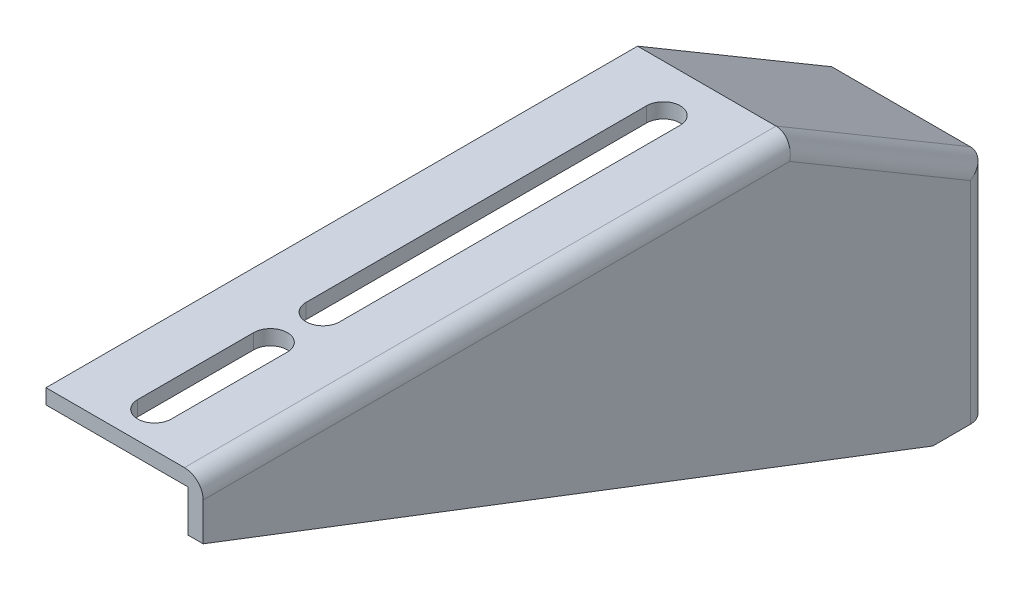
ISO-10303-21;
HEADER;
FILE_DESCRIPTION(('STEP AP214'),'2;1');
FILE_NAME('part.step','',(''),(''),'','','');
FILE_SCHEMA(('AUTOMOTIVE_DESIGN { 1 0 10303 214 1 1 1 1 }'));
ENDSEC;
DATA;
#1=APPLICATION_CONTEXT('core data for automotive mechanical design processes');
#2=APPLICATION_PROTOCOL_DEFINITION('international standard','automotive_design',2000,#1);
#3=PRODUCT_CONTEXT('',#1,'mechanical');
#4=PRODUCT('Part','Part','',(#3));
#5=PRODUCT_RELATED_PRODUCT_CATEGORY('part','',(#4));
#6=PRODUCT_DEFINITION_FORMATION('','',#4);
#7=PRODUCT_DEFINITION_CONTEXT('part definition',#1,'design');
#8=PRODUCT_DEFINITION('design','',#6,#7);
#9=PRODUCT_DEFINITION_SHAPE('','',#8);
#10=(LENGTH_UNIT() NAMED_UNIT(*) SI_UNIT(.MILLI.,.METRE.));
#11=(NAMED_UNIT(*) PLANE_ANGLE_UNIT() SI_UNIT($,.RADIAN.));
#12=(NAMED_UNIT(*) SI_UNIT($,.STERADIAN.) SOLID_ANGLE_UNIT());
#13=UNCERTAINTY_MEASURE_WITH_UNIT(LENGTH_MEASURE(1.E-05),#10,'distance_accuracy_value','');
#14=(GEOMETRIC_REPRESENTATION_CONTEXT(3) GLOBAL_UNCERTAINTY_ASSIGNED_CONTEXT((#13)) GLOBAL_UNIT_ASSIGNED_CONTEXT((#10,
#11,#12)) REPRESENTATION_CONTEXT('',''));
#15=CARTESIAN_POINT('',(0.,0.,0.));
#16=DIRECTION('',(0.,0.,1.));
#17=DIRECTION('',(1.,0.,0.));
#18=AXIS2_PLACEMENT_3D('',#15,#16,#17);
#19=CARTESIAN_POINT('',(17.5,-33.,5.));
#20=DIRECTION('',(0.,1.,0.));
#21=DIRECTION('',(-1.,0.,0.));
#22=AXIS2_PLACEMENT_3D('',#19,#20,#21);
#23=CYLINDRICAL_SURFACE('',#22,5.);
#24=DIRECTION('',(0.,1.,0.));
#25=VECTOR('',#24,1.);
#26=CARTESIAN_POINT('',(17.5,-3.99999999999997,0.));
#27=LINE('',#26,#25);
#28=CARTESIAN_POINT('',(17.5,-90.,0.));
#29=VERTEX_POINT('',#28);
#30=CARTESIAN_POINT('',(17.5,-30.7193009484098,0.));
#31=VERTEX_POINT('',#30);
#32=EDGE_CURVE('E205',#29,#31,#27,.T.);
#33=ORIENTED_EDGE('',*,*,#32,.T.);
#34=CARTESIAN_POINT('',(17.5,-33.5701747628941,5.));
#35=DIRECTION('',(0.,0.868711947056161,0.495317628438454));
#36=DIRECTION('',(0.,-0.495317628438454,0.868711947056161));
#37=AXIS2_PLACEMENT_3D('',#34,#35,#36);
#38=ELLIPSE('',#37,5.75564779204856,5.);
#39=CARTESIAN_POINT('',(22.5,-33.570174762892,5.));
#40=VERTEX_POINT('',#39);
#41=EDGE_CURVE('E183',#40,#31,#38,.T.);
#42=ORIENTED_EDGE('',*,*,#41,.F.);
#43=DIRECTION('',(0.,-1.,0.));
#44=VECTOR('',#43,1.);
#45=CARTESIAN_POINT('',(22.5,-3.99999999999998,5.));
#46=LINE('',#45,#44);
#47=CARTESIAN_POINT('',(22.5,-90.,5.));
#48=VERTEX_POINT('',#47);
#49=EDGE_CURVE('E261',#40,#48,#46,.T.);
#50=ORIENTED_EDGE('',*,*,#49,.T.);
#51=CARTESIAN_POINT('',(17.5,-90.,5.));
#52=DIRECTION('',(0.,1.,0.));
#53=DIRECTION('',(-1.,0.,0.));
#54=AXIS2_PLACEMENT_3D('',#51,#52,#53);
#55=CIRCLE('',#54,5.);
#56=EDGE_CURVE('E262',#29,#48,#55,.F.);
#57=ORIENTED_EDGE('',*,*,#56,.F.);
#58=EDGE_LOOP('',(#33,#42,#50,#57));
#59=FACE_BOUND('',#58,.T.);
#60=ADVANCED_FACE('F15',(#59),#23,.T.);
#61=CARTESIAN_POINT('',(17.5,-4.99999999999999,228.));
#62=DIRECTION('',(0.,0.,1.));
#63=DIRECTION('',(1.,0.,0.));
#64=AXIS2_PLACEMENT_3D('',#61,#62,#63);
#65=CYLINDRICAL_SURFACE('',#64,5.);
#66=DIRECTION('',(0.,0.,1.));
#67=VECTOR('',#66,1.);
#68=CARTESIAN_POINT('',(22.5,-4.99999999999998,53.));
#69=LINE('',#68,#67);
#70=CARTESIAN_POINT('',(22.5,-4.99999999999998,210.));
#71=VERTEX_POINT('',#70);
#72=CARTESIAN_POINT('',(22.5,-4.99999999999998,53.2737435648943));
#73=VERTEX_POINT('',#72);
#74=EDGE_CURVE('E179',#71,#73,#69,.F.);
#75=ORIENTED_EDGE('',*,*,#74,.T.);
#76=CARTESIAN_POINT('',(17.5,-4.99999999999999,53.2737435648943));
#77=DIRECTION('',(0.,0.264029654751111,0.96451456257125));
#78=DIRECTION('',(0.,0.96451456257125,-0.264029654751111));
#79=AXIS2_PLACEMENT_3D('',#76,#77,#78);
#80=ELLIPSE('',#79,5.18395490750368,5.);
#81=CARTESIAN_POINT('',(17.5,0.,51.905025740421));
#82=VERTEX_POINT('',#81);
#83=EDGE_CURVE('E18',#82,#73,#80,.F.);
#84=ORIENTED_EDGE('',*,*,#83,.F.);
#85=DIRECTION('',(0.,0.,-1.));
#86=VECTOR('',#85,1.);
#87=CARTESIAN_POINT('',(17.5,0.,53.));
#88=LINE('',#87,#86);
#89=CARTESIAN_POINT('',(17.5,0.,210.));
#90=VERTEX_POINT('',#89);
#91=EDGE_CURVE('E176',#82,#90,#88,.F.);
#92=ORIENTED_EDGE('',*,*,#91,.T.);
#93=CARTESIAN_POINT('',(17.5,-4.99999999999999,210.));
#94=DIRECTION('',(0.,0.,1.));
#95=DIRECTION('',(1.,0.,0.));
#96=AXIS2_PLACEMENT_3D('',#93,#94,#95);
#97=CIRCLE('',#96,5.);
#98=EDGE_CURVE('E259',#71,#90,#97,.T.);
#99=ORIENTED_EDGE('',*,*,#98,.F.);
#100=EDGE_LOOP('',(#75,#84,#92,#99));
#101=FACE_BOUND('',#100,.T.);
#102=ADVANCED_FACE('F174',(#101),#65,.T.);
#103=CARTESIAN_POINT('',(17.5,-5.35425210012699,52.6751796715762));
#104=DIRECTION('',(0.,0.509320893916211,0.860576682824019));
#105=DIRECTION('',(0.,-0.860576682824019,0.509320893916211));
#106=AXIS2_PLACEMENT_3D('',#103,#104,#105);
#107=CYLINDRICAL_SURFACE('',#106,5.);
#108=DIRECTION('',(0.,-0.509320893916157,-0.860576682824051));
#109=VECTOR('',#108,1.);
#110=CARTESIAN_POINT('',(22.5,-4.99999999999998,53.2737435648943));
#111=LINE('',#110,#109);
#112=EDGE_CURVE('E292',#73,#40,#111,.T.);
#113=ORIENTED_EDGE('',*,*,#112,.T.);
#114=ORIENTED_EDGE('',*,*,#41,.T.);
#115=DIRECTION('',(0.,-0.509320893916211,-0.860576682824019));
#116=VECTOR('',#115,1.);
#117=CARTESIAN_POINT('',(17.5,-0.557693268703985,50.962716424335));
#118=LINE('',#117,#116);
#119=EDGE_CURVE('E185',#31,#82,#118,.F.);
#120=ORIENTED_EDGE('',*,*,#119,.T.);
#121=ORIENTED_EDGE('',*,*,#83,.T.);
#122=EDGE_LOOP('',(#113,#114,#120,#121));
#123=FACE_BOUND('',#122,.T.);
#124=ADVANCED_FACE('F186',(#123),#107,.T.);
#125=CARTESIAN_POINT('',(18.5,0.,53.));
#126=DIRECTION('',(0.,-1.,0.));
#127=DIRECTION('',(0.,0.,-1.));
#128=AXIS2_PLACEMENT_3D('',#125,#126,#127);
#129=PLANE('',#128);
#130=DIRECTION('',(0.,0.,1.));
#131=VECTOR('',#130,1.);
#132=CARTESIAN_POINT('',(-4.50000000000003,0.,155.5));
#133=LINE('',#132,#131);
#134=CARTESIAN_POINT('',(-4.50000000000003,0.,155.5));
#135=VERTEX_POINT('',#134);
#136=CARTESIAN_POINT('',(-4.50000000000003,0.,64.5));
#137=VERTEX_POINT('',#136);
#138=EDGE_CURVE('E283',#135,#137,#133,.F.);
#139=ORIENTED_EDGE('',*,*,#138,.T.);
#140=CARTESIAN_POINT('',(0.,0.,64.5));
#141=DIRECTION('',(0.,1.,0.));
#142=DIRECTION('',(-1.,0.,0.));
#143=AXIS2_PLACEMENT_3D('',#140,#141,#142);
#144=CIRCLE('',#143,4.5);
#145=CARTESIAN_POINT('',(4.49999999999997,0.,64.5));
#146=VERTEX_POINT('',#145);
#147=EDGE_CURVE('E244',#137,#146,#144,.F.);
#148=ORIENTED_EDGE('',*,*,#147,.T.);
#149=DIRECTION('',(0.,0.,1.));
#150=VECTOR('',#149,1.);
#151=CARTESIAN_POINT('',(4.49999999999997,0.,64.5));
#152=LINE('',#151,#150);
#153=CARTESIAN_POINT('',(4.49999999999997,0.,155.5));
#154=VERTEX_POINT('',#153);
#155=EDGE_CURVE('E250',#146,#154,#152,.T.);
#156=ORIENTED_EDGE('',*,*,#155,.T.);
#157=CARTESIAN_POINT('',(0.,0.,155.5));
#158=DIRECTION('',(0.,1.,0.));
#159=DIRECTION('',(-1.,0.,0.));
#160=AXIS2_PLACEMENT_3D('',#157,#158,#159);
#161=CIRCLE('',#160,4.5);
#162=EDGE_CURVE('E248',#154,#135,#161,.F.);
#163=ORIENTED_EDGE('',*,*,#162,.T.);
#164=EDGE_LOOP('',(#139,#148,#156,#163));
#165=FACE_BOUND('',#164,.T.);
#166=DIRECTION('',(0.,0.,1.));
#167=VECTOR('',#166,1.);
#168=CARTESIAN_POINT('',(-4.50000000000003,0.,200.5));
#169=LINE('',#168,#167);
#170=CARTESIAN_POINT('',(-4.50000000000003,0.,200.5));
#171=VERTEX_POINT('',#170);
#172=CARTESIAN_POINT('',(-4.50000000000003,0.,169.5));
#173=VERTEX_POINT('',#172);
#174=EDGE_CURVE('E288',#171,#173,#169,.F.);
#175=ORIENTED_EDGE('',*,*,#174,.T.);
#176=CARTESIAN_POINT('',(0.,0.,169.5));
#177=DIRECTION('',(0.,1.,0.));
#178=DIRECTION('',(-1.,0.,0.));
#179=AXIS2_PLACEMENT_3D('',#176,#177,#178);
#180=CIRCLE('',#179,4.5);
#181=CARTESIAN_POINT('',(4.49999999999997,0.,169.5));
#182=VERTEX_POINT('',#181);
#183=EDGE_CURVE('E252',#173,#182,#180,.F.);
#184=ORIENTED_EDGE('',*,*,#183,.T.);
#185=DIRECTION('',(0.,0.,1.));
#186=VECTOR('',#185,1.);
#187=CARTESIAN_POINT('',(4.49999999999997,0.,169.5));
#188=LINE('',#187,#186);
#189=CARTESIAN_POINT('',(4.49999999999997,0.,200.5));
#190=VERTEX_POINT('',#189);
#191=EDGE_CURVE('E258',#182,#190,#188,.T.);
#192=ORIENTED_EDGE('',*,*,#191,.T.);
#193=CARTESIAN_POINT('',(0.,0.,200.5));
#194=DIRECTION('',(0.,1.,0.));
#195=DIRECTION('',(-1.,0.,0.));
#196=AXIS2_PLACEMENT_3D('',#193,#194,#195);
#197=CIRCLE('',#196,4.5);
#198=EDGE_CURVE('E256',#190,#171,#197,.F.);
#199=ORIENTED_EDGE('',*,*,#198,.T.);
#200=EDGE_LOOP('',(#175,#184,#192,#199));
#201=FACE_BOUND('',#200,.T.);
#202=DIRECTION('',(1.,0.,0.));
#203=VECTOR('',#202,1.);
#204=CARTESIAN_POINT('',(5.07325658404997,0.,210.));
#205=LINE('',#204,#203);
#206=CARTESIAN_POINT('',(-19.5,0.,210.));
#207=VERTEX_POINT('',#206);
#208=EDGE_CURVE('E197',#90,#207,#205,.F.);
#209=ORIENTED_EDGE('',*,*,#208,.F.);
#210=ORIENTED_EDGE('',*,*,#91,.F.);
#211=DIRECTION('',(1.,0.,0.));
#212=VECTOR('',#211,1.);
#213=CARTESIAN_POINT('',(18.5,0.,51.905025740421));
#214=LINE('',#213,#212);
#215=CARTESIAN_POINT('',(-19.5,0.,51.905025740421));
#216=VERTEX_POINT('',#215);
#217=EDGE_CURVE('E190',#82,#216,#214,.F.);
#218=ORIENTED_EDGE('',*,*,#217,.T.);
#219=DIRECTION('',(0.,0.,1.));
#220=VECTOR('',#219,1.);
#221=CARTESIAN_POINT('',(-19.5,0.,27.48135821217));
#222=LINE('',#221,#220);
#223=EDGE_CURVE('E314',#207,#216,#222,.F.);
#224=ORIENTED_EDGE('',*,*,#223,.F.);
#225=EDGE_LOOP('',(#209,#210,#218,#224));
#226=FACE_BOUND('',#225,.T.);
#227=ADVANCED_FACE('F194',(#165,#201,#226),#129,.F.);
#228=CARTESIAN_POINT('',(18.5,-0.557693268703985,50.962716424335));
#229=DIRECTION('',(0.,-0.860576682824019,0.509320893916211));
#230=DIRECTION('',(0.,-0.509320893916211,-0.860576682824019));
#231=AXIS2_PLACEMENT_3D('',#228,#229,#230);
#232=PLANE('',#231);
#233=ORIENTED_EDGE('',*,*,#217,.F.);
#234=ORIENTED_EDGE('',*,*,#119,.F.);
#235=DIRECTION('',(1.,0.,0.));
#236=VECTOR('',#235,1.);
#237=CARTESIAN_POINT('',(67.5,-30.71930094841,0.));
#238=LINE('',#237,#236);
#239=CARTESIAN_POINT('',(-19.5,-30.71930094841,0.));
#240=VERTEX_POINT('',#239);
#241=EDGE_CURVE('E203',#31,#240,#238,.F.);
#242=ORIENTED_EDGE('',*,*,#241,.T.);
#243=DIRECTION('',(0.,-0.509320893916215,-0.860576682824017));
#244=VECTOR('',#243,1.);
#245=CARTESIAN_POINT('',(-19.5,0.,51.905025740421));
#246=LINE('',#245,#244);
#247=EDGE_CURVE('E201',#216,#240,#246,.T.);
#248=ORIENTED_EDGE('',*,*,#247,.F.);
#249=EDGE_LOOP('',(#233,#234,#242,#248));
#250=FACE_BOUND('',#249,.T.);
#251=ADVANCED_FACE('F199',(#250),#232,.F.);
#252=CARTESIAN_POINT('',(67.5,-3.99999999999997,0.));
#253=DIRECTION('',(0.,0.,1.));
#254=DIRECTION('',(1.,0.,0.));
#255=AXIS2_PLACEMENT_3D('',#252,#253,#254);
#256=PLANE('',#255);
#257=DIRECTION('',(0.,-1.,0.));
#258=VECTOR('',#257,1.);
#259=CARTESIAN_POINT('',(-4.50000000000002,-46.5,0.));
#260=LINE('',#259,#258);
#261=CARTESIAN_POINT('',(-4.50000000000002,-46.5,0.));
#262=VERTEX_POINT('',#261);
#263=CARTESIAN_POINT('',(-4.50000000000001,-77.5,0.));
#264=VERTEX_POINT('',#263);
#265=EDGE_CURVE('E242',#262,#264,#260,.T.);
#266=ORIENTED_EDGE('',*,*,#265,.T.);
#267=CARTESIAN_POINT('',(0.,-77.5,0.));
#268=DIRECTION('',(0.,0.,-1.));
#269=DIRECTION('',(-1.,0.,0.));
#270=AXIS2_PLACEMENT_3D('',#267,#268,#269);
#271=CIRCLE('',#270,4.5);
#272=CARTESIAN_POINT('',(4.49999999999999,-77.5,0.));
#273=VERTEX_POINT('',#272);
#274=EDGE_CURVE('E240',#264,#273,#271,.F.);
#275=ORIENTED_EDGE('',*,*,#274,.T.);
#276=DIRECTION('',(0.,1.,0.));
#277=VECTOR('',#276,1.);
#278=CARTESIAN_POINT('',(4.49999999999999,-77.5,0.));
#279=LINE('',#278,#277);
#280=CARTESIAN_POINT('',(4.49999999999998,-46.5,0.));
#281=VERTEX_POINT('',#280);
#282=EDGE_CURVE('E273',#273,#281,#279,.T.);
#283=ORIENTED_EDGE('',*,*,#282,.T.);
#284=CARTESIAN_POINT('',(0.,-46.5,0.));
#285=DIRECTION('',(0.,0.,-1.));
#286=DIRECTION('',(-1.,0.,0.));
#287=AXIS2_PLACEMENT_3D('',#284,#285,#286);
#288=CIRCLE('',#287,4.5);
#289=EDGE_CURVE('E236',#281,#262,#288,.F.);
#290=ORIENTED_EDGE('',*,*,#289,.T.);
#291=EDGE_LOOP('',(#266,#275,#283,#290));
#292=FACE_BOUND('',#291,.T.);
#293=DIRECTION('',(1.,0.,0.));
#294=VECTOR('',#293,1.);
#295=CARTESIAN_POINT('',(5.,-90.,0.));
#296=LINE('',#295,#294);
#297=CARTESIAN_POINT('',(-19.5,-90.,0.));
#298=VERTEX_POINT('',#297);
#299=EDGE_CURVE('E275',#298,#29,#296,.T.);
#300=ORIENTED_EDGE('',*,*,#299,.F.);
#301=DIRECTION('',(0.,-1.,0.));
#302=VECTOR('',#301,1.);
#303=CARTESIAN_POINT('',(-19.5,-16.77884663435,0.));
#304=LINE('',#303,#302);
#305=EDGE_CURVE('E311',#240,#298,#304,.T.);
#306=ORIENTED_EDGE('',*,*,#305,.F.);
#307=ORIENTED_EDGE('',*,*,#241,.F.);
#308=ORIENTED_EDGE('',*,*,#32,.F.);
#309=EDGE_LOOP('',(#300,#306,#307,#308));
#310=FACE_BOUND('',#309,.T.);
#311=ADVANCED_FACE('F368',(#292,#310),#256,.F.);
#312=CARTESIAN_POINT('',(22.5,-3.99999999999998,53.));
#313=DIRECTION('',(-1.,0.,0.));
#314=DIRECTION('',(0.,-1.,0.));
#315=AXIS2_PLACEMENT_3D('',#312,#313,#314);
#316=PLANE('',#315);
#317=ORIENTED_EDGE('',*,*,#74,.F.);
#318=DIRECTION('',(0.,1.,0.));
#319=VECTOR('',#318,1.);
#320=CARTESIAN_POINT('',(22.5,9.42674341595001,210.));
#321=LINE('',#320,#319);
#322=CARTESIAN_POINT('',(22.5,-15.146513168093,210.000000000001));
#323=VERTEX_POINT('',#322);
#324=EDGE_CURVE('E297',#323,#71,#321,.T.);
#325=ORIENTED_EDGE('',*,*,#324,.F.);
#326=DIRECTION('',(0.,-0.358367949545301,-0.933580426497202));
#327=VECTOR('',#326,1.);
#328=CARTESIAN_POINT('',(22.5,-52.57325658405,112.5));
#329=LINE('',#328,#327);
#330=CARTESIAN_POINT('',(22.5,-90.0000000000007,15.0000000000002));
#331=VERTEX_POINT('',#330);
#332=EDGE_CURVE('E398',#331,#323,#329,.F.);
#333=ORIENTED_EDGE('',*,*,#332,.F.);
#334=DIRECTION('',(0.,0.,-1.));
#335=VECTOR('',#334,1.);
#336=CARTESIAN_POINT('',(22.5,-90.,-9.49999999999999));
#337=LINE('',#336,#335);
#338=EDGE_CURVE('E342',#48,#331,#337,.F.);
#339=ORIENTED_EDGE('',*,*,#338,.F.);
#340=ORIENTED_EDGE('',*,*,#49,.F.);
#341=ORIENTED_EDGE('',*,*,#112,.F.);
#342=EDGE_LOOP('',(#317,#325,#333,#339,#340,#341));
#343=FACE_BOUND('',#342,.T.);
#344=ADVANCED_FACE('F411',(#343),#316,.F.);
#345=CARTESIAN_POINT('',(0.,-3.99999999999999,200.5));
#346=DIRECTION('',(0.,1.,0.));
#347=DIRECTION('',(-1.,0.,0.));
#348=AXIS2_PLACEMENT_3D('',#345,#346,#347);
#349=CYLINDRICAL_SURFACE('',#348,4.5);
#350=DIRECTION('',(0.,-1.,0.));
#351=VECTOR('',#350,1.);
#352=CARTESIAN_POINT('',(-4.50000000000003,-3.99999999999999,200.5));
#353=LINE('',#352,#351);
#354=CARTESIAN_POINT('',(-4.50000000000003,-3.99999999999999,200.5));
#355=VERTEX_POINT('',#354);
#356=EDGE_CURVE('E290',#355,#171,#353,.F.);
#357=ORIENTED_EDGE('',*,*,#356,.T.);
#358=ORIENTED_EDGE('',*,*,#198,.F.);
#359=DIRECTION('',(0.,1.,0.));
#360=VECTOR('',#359,1.);
#361=CARTESIAN_POINT('',(4.49999999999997,-3.99999999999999,200.5));
#362=LINE('',#361,#360);
#363=CARTESIAN_POINT('',(4.49999999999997,-3.99999999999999,200.5));
#364=VERTEX_POINT('',#363);
#365=EDGE_CURVE('E255',#190,#364,#362,.F.);
#366=ORIENTED_EDGE('',*,*,#365,.T.);
#367=CARTESIAN_POINT('',(0.,-3.99999999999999,200.5));
#368=DIRECTION('',(0.,1.,0.));
#369=DIRECTION('',(-1.,0.,0.));
#370=AXIS2_PLACEMENT_3D('',#367,#368,#369);
#371=CIRCLE('',#370,4.5);
#372=EDGE_CURVE('E232',#355,#364,#371,.T.);
#373=ORIENTED_EDGE('',*,*,#372,.F.);
#374=EDGE_LOOP('',(#357,#358,#366,#373));
#375=FACE_BOUND('',#374,.T.);
#376=ADVANCED_FACE('F439',(#375),#349,.F.);
#377=CARTESIAN_POINT('',(4.49999999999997,-3.99999999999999,169.5));
#378=DIRECTION('',(1.,0.,0.));
#379=DIRECTION('',(0.,1.,0.));
#380=AXIS2_PLACEMENT_3D('',#377,#378,#379);
#381=PLANE('',#380);
#382=ORIENTED_EDGE('',*,*,#365,.F.);
#383=ORIENTED_EDGE('',*,*,#191,.F.);
#384=DIRECTION('',(0.,1.,0.));
#385=VECTOR('',#384,1.);
#386=CARTESIAN_POINT('',(4.49999999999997,-3.99999999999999,169.5));
#387=LINE('',#386,#385);
#388=CARTESIAN_POINT('',(4.49999999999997,-3.99999999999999,169.5));
#389=VERTEX_POINT('',#388);
#390=EDGE_CURVE('E254',#182,#389,#387,.F.);
#391=ORIENTED_EDGE('',*,*,#390,.T.);
#392=DIRECTION('',(0.,0.,-1.));
#393=VECTOR('',#392,1.);
#394=CARTESIAN_POINT('',(4.49999999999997,-3.99999999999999,53.));
#395=LINE('',#394,#393);
#396=EDGE_CURVE('E231',#364,#389,#395,.T.);
#397=ORIENTED_EDGE('',*,*,#396,.F.);
#398=EDGE_LOOP('',(#382,#383,#391,#397));
#399=FACE_BOUND('',#398,.T.);
#400=ADVANCED_FACE('F497',(#399),#381,.F.);
#401=CARTESIAN_POINT('',(0.,-3.99999999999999,169.5));
#402=DIRECTION('',(0.,1.,0.));
#403=DIRECTION('',(-1.,0.,0.));
#404=AXIS2_PLACEMENT_3D('',#401,#402,#403);
#405=CYLINDRICAL_SURFACE('',#404,4.5);
#406=ORIENTED_EDGE('',*,*,#390,.F.);
#407=ORIENTED_EDGE('',*,*,#183,.F.);
#408=DIRECTION('',(0.,-1.,0.));
#409=VECTOR('',#408,1.);
#410=CARTESIAN_POINT('',(-4.50000000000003,-3.99999999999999,169.5));
#411=LINE('',#410,#409);
#412=CARTESIAN_POINT('',(-4.50000000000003,-3.99999999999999,169.5));
#413=VERTEX_POINT('',#412);
#414=EDGE_CURVE('E251',#173,#413,#411,.T.);
#415=ORIENTED_EDGE('',*,*,#414,.T.);
#416=CARTESIAN_POINT('',(0.,-3.99999999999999,169.5));
#417=DIRECTION('',(0.,1.,0.));
#418=DIRECTION('',(-1.,0.,0.));
#419=AXIS2_PLACEMENT_3D('',#416,#417,#418);
#420=CIRCLE('',#419,4.5);
#421=EDGE_CURVE('E228',#389,#413,#420,.T.);
#422=ORIENTED_EDGE('',*,*,#421,.F.);
#423=EDGE_LOOP('',(#406,#407,#415,#422));
#424=FACE_BOUND('',#423,.T.);
#425=ADVANCED_FACE('F493',(#424),#405,.F.);
#426=CARTESIAN_POINT('',(-4.50000000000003,-3.99999999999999,200.5));
#427=DIRECTION('',(-1.,0.,0.));
#428=DIRECTION('',(0.,-1.,0.));
#429=AXIS2_PLACEMENT_3D('',#426,#427,#428);
#430=PLANE('',#429);
#431=ORIENTED_EDGE('',*,*,#414,.F.);
#432=ORIENTED_EDGE('',*,*,#174,.F.);
#433=ORIENTED_EDGE('',*,*,#356,.F.);
#434=DIRECTION('',(0.,0.,-1.));
#435=VECTOR('',#434,1.);
#436=CARTESIAN_POINT('',(-4.50000000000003,-3.99999999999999,53.));
#437=LINE('',#436,#435);
#438=EDGE_CURVE('E227',#413,#355,#437,.F.);
#439=ORIENTED_EDGE('',*,*,#438,.F.);
#440=EDGE_LOOP('',(#431,#432,#433,#439));
#441=FACE_BOUND('',#440,.T.);
#442=ADVANCED_FACE('F489',(#441),#430,.F.);
#443=CARTESIAN_POINT('',(0.,-3.99999999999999,155.5));
#444=DIRECTION('',(0.,1.,0.));
#445=DIRECTION('',(-1.,0.,0.));
#446=AXIS2_PLACEMENT_3D('',#443,#444,#445);
#447=CYLINDRICAL_SURFACE('',#446,4.5);
#448=DIRECTION('',(0.,-1.,0.));
#449=VECTOR('',#448,1.);
#450=CARTESIAN_POINT('',(-4.50000000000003,-3.99999999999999,155.5));
#451=LINE('',#450,#449);
#452=CARTESIAN_POINT('',(-4.50000000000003,-3.99999999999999,155.5));
#453=VERTEX_POINT('',#452);
#454=EDGE_CURVE('E286',#453,#135,#451,.F.);
#455=ORIENTED_EDGE('',*,*,#454,.T.);
#456=ORIENTED_EDGE('',*,*,#162,.F.);
#457=DIRECTION('',(0.,1.,0.));
#458=VECTOR('',#457,1.);
#459=CARTESIAN_POINT('',(4.49999999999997,-3.99999999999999,155.5));
#460=LINE('',#459,#458);
#461=CARTESIAN_POINT('',(4.49999999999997,-3.99999999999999,155.5));
#462=VERTEX_POINT('',#461);
#463=EDGE_CURVE('E247',#154,#462,#460,.F.);
#464=ORIENTED_EDGE('',*,*,#463,.T.);
#465=CARTESIAN_POINT('',(0.,-3.99999999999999,155.5));
#466=DIRECTION('',(0.,1.,0.));
#467=DIRECTION('',(-1.,0.,0.));
#468=AXIS2_PLACEMENT_3D('',#465,#466,#467);
#469=CIRCLE('',#468,4.5);
#470=EDGE_CURVE('E224',#453,#462,#469,.T.);
#471=ORIENTED_EDGE('',*,*,#470,.F.);
#472=EDGE_LOOP('',(#455,#456,#464,#471));
#473=FACE_BOUND('',#472,.T.);
#474=ADVANCED_FACE('F485',(#473),#447,.F.);
#475=CARTESIAN_POINT('',(4.49999999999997,-3.99999999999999,64.5));
#476=DIRECTION('',(1.,0.,0.));
#477=DIRECTION('',(0.,1.,0.));
#478=AXIS2_PLACEMENT_3D('',#475,#476,#477);
#479=PLANE('',#478);
#480=ORIENTED_EDGE('',*,*,#463,.F.);
#481=ORIENTED_EDGE('',*,*,#155,.F.);
#482=DIRECTION('',(0.,1.,0.));
#483=VECTOR('',#482,1.);
#484=CARTESIAN_POINT('',(4.49999999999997,-3.99999999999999,64.5));
#485=LINE('',#484,#483);
#486=CARTESIAN_POINT('',(4.49999999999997,-3.99999999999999,64.5));
#487=VERTEX_POINT('',#486);
#488=EDGE_CURVE('E246',#146,#487,#485,.F.);
#489=ORIENTED_EDGE('',*,*,#488,.T.);
#490=DIRECTION('',(0.,0.,-1.));
#491=VECTOR('',#490,1.);
#492=CARTESIAN_POINT('',(4.49999999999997,-3.99999999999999,53.));
#493=LINE('',#492,#491);
#494=EDGE_CURVE('E223',#462,#487,#493,.T.);
#495=ORIENTED_EDGE('',*,*,#494,.F.);
#496=EDGE_LOOP('',(#480,#481,#489,#495));
#497=FACE_BOUND('',#496,.T.);
#498=ADVANCED_FACE('F481',(#497),#479,.F.);
#499=CARTESIAN_POINT('',(0.,-3.99999999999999,64.5));
#500=DIRECTION('',(0.,1.,0.));
#501=DIRECTION('',(-1.,0.,0.));
#502=AXIS2_PLACEMENT_3D('',#499,#500,#501);
#503=CYLINDRICAL_SURFACE('',#502,4.5);
#504=ORIENTED_EDGE('',*,*,#488,.F.);
#505=ORIENTED_EDGE('',*,*,#147,.F.);
#506=DIRECTION('',(0.,-1.,0.));
#507=VECTOR('',#506,1.);
#508=CARTESIAN_POINT('',(-4.50000000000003,-3.99999999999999,64.5));
#509=LINE('',#508,#507);
#510=CARTESIAN_POINT('',(-4.50000000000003,-3.99999999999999,64.5));
#511=VERTEX_POINT('',#510);
#512=EDGE_CURVE('E285',#137,#511,#509,.T.);
#513=ORIENTED_EDGE('',*,*,#512,.T.);
#514=CARTESIAN_POINT('',(0.,-3.99999999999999,64.5));
#515=DIRECTION('',(0.,1.,0.));
#516=DIRECTION('',(-1.,0.,0.));
#517=AXIS2_PLACEMENT_3D('',#514,#515,#516);
#518=CIRCLE('',#517,4.5);
#519=EDGE_CURVE('E219',#487,#511,#518,.T.);
#520=ORIENTED_EDGE('',*,*,#519,.F.);
#521=EDGE_LOOP('',(#504,#505,#513,#520));
#522=FACE_BOUND('',#521,.T.);
#523=ADVANCED_FACE('F477',(#522),#503,.F.);
#524=CARTESIAN_POINT('',(-4.50000000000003,-3.99999999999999,155.5));
#525=DIRECTION('',(-1.,0.,0.));
#526=DIRECTION('',(0.,-1.,0.));
#527=AXIS2_PLACEMENT_3D('',#524,#525,#526);
#528=PLANE('',#527);
#529=ORIENTED_EDGE('',*,*,#512,.F.);
#530=ORIENTED_EDGE('',*,*,#138,.F.);
#531=ORIENTED_EDGE('',*,*,#454,.F.);
#532=DIRECTION('',(0.,0.,-1.));
#533=VECTOR('',#532,1.);
#534=CARTESIAN_POINT('',(-4.50000000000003,-3.99999999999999,53.));
#535=LINE('',#534,#533);
#536=EDGE_CURVE('E222',#511,#453,#535,.F.);
#537=ORIENTED_EDGE('',*,*,#536,.F.);
#538=EDGE_LOOP('',(#529,#530,#531,#537));
#539=FACE_BOUND('',#538,.T.);
#540=ADVANCED_FACE('F474',(#539),#528,.F.);
#541=CARTESIAN_POINT('',(-19.5,-16.77884663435,27.48135821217));
#542=DIRECTION('',(-1.,0.,0.));
#543=DIRECTION('',(0.,-1.,0.));
#544=AXIS2_PLACEMENT_3D('',#541,#542,#543);
#545=PLANE('',#544);
#546=DIRECTION('',(0.,0.,-1.));
#547=VECTOR('',#546,1.);
#548=CARTESIAN_POINT('',(-19.5,-90.,1.99999999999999));
#549=LINE('',#548,#547);
#550=CARTESIAN_POINT('',(-19.5,-90.,4.));
#551=VERTEX_POINT('',#550);
#552=EDGE_CURVE('E277',#551,#298,#549,.T.);
#553=ORIENTED_EDGE('',*,*,#552,.F.);
#554=DIRECTION('',(0.,1.,0.));
#555=VECTOR('',#554,1.);
#556=CARTESIAN_POINT('',(-19.5,-3.99999999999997,4.));
#557=LINE('',#556,#555);
#558=CARTESIAN_POINT('',(-19.5,-32.999999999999,3.99999999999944));
#559=VERTEX_POINT('',#558);
#560=EDGE_CURVE('E280',#559,#551,#557,.F.);
#561=ORIENTED_EDGE('',*,*,#560,.F.);
#562=DIRECTION('',(0.,-0.509320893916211,-0.860576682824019));
#563=VECTOR('',#562,1.);
#564=CARTESIAN_POINT('',(-19.5,-3.99999999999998,53.));
#565=LINE('',#564,#563);
#566=CARTESIAN_POINT('',(-19.5,-3.99999999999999,53.));
#567=VERTEX_POINT('',#566);
#568=EDGE_CURVE('E382',#567,#559,#565,.T.);
#569=ORIENTED_EDGE('',*,*,#568,.F.);
#570=DIRECTION('',(0.,0.,-1.));
#571=VECTOR('',#570,1.);
#572=CARTESIAN_POINT('',(-19.5,-3.99999999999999,53.));
#573=LINE('',#572,#571);
#574=CARTESIAN_POINT('',(-19.5,-4.,210.));
#575=VERTEX_POINT('',#574);
#576=EDGE_CURVE('E235',#575,#567,#573,.T.);
#577=ORIENTED_EDGE('',*,*,#576,.F.);
#578=DIRECTION('',(0.,-1.,0.));
#579=VECTOR('',#578,1.);
#580=CARTESIAN_POINT('',(-19.5,-16.77884663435,210.));
#581=LINE('',#580,#579);
#582=EDGE_CURVE('E316',#575,#207,#581,.F.);
#583=ORIENTED_EDGE('',*,*,#582,.T.);
#584=ORIENTED_EDGE('',*,*,#223,.T.);
#585=ORIENTED_EDGE('',*,*,#247,.T.);
#586=ORIENTED_EDGE('',*,*,#305,.T.);
#587=EDGE_LOOP('',(#553,#561,#569,#577,#583,#584,#585,#586));
#588=FACE_BOUND('',#587,.T.);
#589=ADVANCED_FACE('F426',(#588),#545,.T.);
#590=CARTESIAN_POINT('',(4.49999999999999,-77.5,4.));
#591=DIRECTION('',(1.,0.,0.));
#592=DIRECTION('',(0.,1.,0.));
#593=AXIS2_PLACEMENT_3D('',#590,#591,#592);
#594=PLANE('',#593);
#595=ORIENTED_EDGE('',*,*,#282,.F.);
#596=DIRECTION('',(0.,0.,-1.));
#597=VECTOR('',#596,1.);
#598=CARTESIAN_POINT('',(4.49999999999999,-77.5,4.));
#599=LINE('',#598,#597);
#600=CARTESIAN_POINT('',(4.49999999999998,-77.5,4.));
#601=VERTEX_POINT('',#600);
#602=EDGE_CURVE('E243',#273,#601,#599,.F.);
#603=ORIENTED_EDGE('',*,*,#602,.T.);
#604=DIRECTION('',(0.,1.,0.));
#605=VECTOR('',#604,1.);
#606=CARTESIAN_POINT('',(4.49999999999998,-3.99999999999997,4.));
#607=LINE('',#606,#605);
#608=CARTESIAN_POINT('',(4.49999999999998,-46.5,4.));
#609=VERTEX_POINT('',#608);
#610=EDGE_CURVE('E218',#609,#601,#607,.F.);
#611=ORIENTED_EDGE('',*,*,#610,.F.);
#612=DIRECTION('',(0.,0.,1.));
#613=VECTOR('',#612,1.);
#614=CARTESIAN_POINT('',(4.49999999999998,-46.5,4.));
#615=LINE('',#614,#613);
#616=EDGE_CURVE('E360',#281,#609,#615,.T.);
#617=ORIENTED_EDGE('',*,*,#616,.F.);
#618=EDGE_LOOP('',(#595,#603,#611,#617));
#619=FACE_BOUND('',#618,.T.);
#620=ADVANCED_FACE('F372',(#619),#594,.F.);
#621=CARTESIAN_POINT('',(0.,-77.5,4.));
#622=DIRECTION('',(0.,0.,-1.));
#623=DIRECTION('',(-1.,0.,0.));
#624=AXIS2_PLACEMENT_3D('',#621,#622,#623);
#625=CYLINDRICAL_SURFACE('',#624,4.5);
#626=ORIENTED_EDGE('',*,*,#274,.F.);
#627=DIRECTION('',(0.,0.,1.));
#628=VECTOR('',#627,1.);
#629=CARTESIAN_POINT('',(-4.50000000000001,-77.5,4.));
#630=LINE('',#629,#628);
#631=CARTESIAN_POINT('',(-4.50000000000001,-77.5,4.));
#632=VERTEX_POINT('',#631);
#633=EDGE_CURVE('E239',#264,#632,#630,.T.);
#634=ORIENTED_EDGE('',*,*,#633,.T.);
#635=CARTESIAN_POINT('',(0.,-77.5,4.));
#636=DIRECTION('',(0.,0.,-1.));
#637=DIRECTION('',(-1.,0.,0.));
#638=AXIS2_PLACEMENT_3D('',#635,#636,#637);
#639=CIRCLE('',#638,4.5);
#640=EDGE_CURVE('E215',#601,#632,#639,.T.);
#641=ORIENTED_EDGE('',*,*,#640,.F.);
#642=ORIENTED_EDGE('',*,*,#602,.F.);
#643=EDGE_LOOP('',(#626,#634,#641,#642));
#644=FACE_BOUND('',#643,.T.);
#645=ADVANCED_FACE('F466',(#644),#625,.F.);
#646=CARTESIAN_POINT('',(-4.50000000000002,-46.5,4.));
#647=DIRECTION('',(-1.,0.,0.));
#648=DIRECTION('',(0.,-1.,0.));
#649=AXIS2_PLACEMENT_3D('',#646,#647,#648);
#650=PLANE('',#649);
#651=DIRECTION('',(0.,1.,0.));
#652=VECTOR('',#651,1.);
#653=CARTESIAN_POINT('',(-4.5,-3.99999999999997,4.));
#654=LINE('',#653,#652);
#655=CARTESIAN_POINT('',(-4.50000000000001,-46.5,4.));
#656=VERTEX_POINT('',#655);
#657=EDGE_CURVE('E214',#632,#656,#654,.T.);
#658=ORIENTED_EDGE('',*,*,#657,.F.);
#659=ORIENTED_EDGE('',*,*,#633,.F.);
#660=ORIENTED_EDGE('',*,*,#265,.F.);
#661=DIRECTION('',(0.,0.,-1.));
#662=VECTOR('',#661,1.);
#663=CARTESIAN_POINT('',(-4.50000000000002,-46.5,4.));
#664=LINE('',#663,#662);
#665=EDGE_CURVE('E238',#262,#656,#664,.F.);
#666=ORIENTED_EDGE('',*,*,#665,.T.);
#667=EDGE_LOOP('',(#658,#659,#660,#666));
#668=FACE_BOUND('',#667,.T.);
#669=ADVANCED_FACE('F463',(#668),#650,.F.);
#670=CARTESIAN_POINT('',(0.,-46.5,4.));
#671=DIRECTION('',(0.,0.,-1.));
#672=DIRECTION('',(-1.,0.,0.));
#673=AXIS2_PLACEMENT_3D('',#670,#671,#672);
#674=CYLINDRICAL_SURFACE('',#673,4.5);
#675=CARTESIAN_POINT('',(0.,-46.5,4.));
#676=DIRECTION('',(0.,0.,-1.));
#677=DIRECTION('',(-1.,0.,0.));
#678=AXIS2_PLACEMENT_3D('',#675,#676,#677);
#679=CIRCLE('',#678,4.5);
#680=EDGE_CURVE('E211',#656,#609,#679,.T.);
#681=ORIENTED_EDGE('',*,*,#680,.F.);
#682=ORIENTED_EDGE('',*,*,#665,.F.);
#683=ORIENTED_EDGE('',*,*,#289,.F.);
#684=ORIENTED_EDGE('',*,*,#616,.T.);
#685=EDGE_LOOP('',(#681,#682,#683,#684));
#686=FACE_BOUND('',#685,.T.);
#687=ADVANCED_FACE('F460',(#686),#674,.F.);
#688=CARTESIAN_POINT('',(20.5,-90.,-9.49999999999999));
#689=DIRECTION('',(0.,-1.,0.));
#690=DIRECTION('',(0.,0.,-1.));
#691=AXIS2_PLACEMENT_3D('',#688,#689,#690);
#692=PLANE('',#691);
#693=DIRECTION('',(1.,0.,0.));
#694=VECTOR('',#693,1.);
#695=CARTESIAN_POINT('',(20.5,-90.0000000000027,15.000000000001));
#696=LINE('',#695,#694);
#697=CARTESIAN_POINT('',(18.5,-90.0000000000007,15.0000000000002));
#698=VERTEX_POINT('',#697);
#699=EDGE_CURVE('E344',#698,#331,#696,.T.);
#700=ORIENTED_EDGE('',*,*,#699,.F.);
#701=DIRECTION('',(0.,0.,1.));
#702=VECTOR('',#701,1.);
#703=CARTESIAN_POINT('',(18.5,-90.,53.));
#704=LINE('',#703,#702);
#705=CARTESIAN_POINT('',(18.5,-90.,4.));
#706=VERTEX_POINT('',#705);
#707=EDGE_CURVE('E213',#706,#698,#704,.T.);
#708=ORIENTED_EDGE('',*,*,#707,.F.);
#709=DIRECTION('',(1.,0.,0.));
#710=VECTOR('',#709,1.);
#711=CARTESIAN_POINT('',(67.5,-90.,4.));
#712=LINE('',#711,#710);
#713=EDGE_CURVE('E278',#551,#706,#712,.T.);
#714=ORIENTED_EDGE('',*,*,#713,.F.);
#715=ORIENTED_EDGE('',*,*,#552,.T.);
#716=ORIENTED_EDGE('',*,*,#299,.T.);
#717=ORIENTED_EDGE('',*,*,#56,.T.);
#718=ORIENTED_EDGE('',*,*,#338,.T.);
#719=EDGE_LOOP('',(#700,#708,#714,#715,#716,#717,#718));
#720=FACE_BOUND('',#719,.T.);
#721=ADVANCED_FACE('F407',(#720),#692,.T.);
#722=CARTESIAN_POINT('',(20.5,-52.57325658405,112.5));
#723=DIRECTION('',(0.,-0.933580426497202,0.358367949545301));
#724=DIRECTION('',(0.,-0.358367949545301,-0.933580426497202));
#725=AXIS2_PLACEMENT_3D('',#722,#723,#724);
#726=PLANE('',#725);
#727=ORIENTED_EDGE('',*,*,#332,.T.);
#728=DIRECTION('',(1.,0.,0.));
#729=VECTOR('',#728,1.);
#730=CARTESIAN_POINT('',(20.5,-15.14651316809,210.));
#731=LINE('',#730,#729);
#732=CARTESIAN_POINT('',(18.5,-15.146513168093,210.000000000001));
#733=VERTEX_POINT('',#732);
#734=EDGE_CURVE('E336',#733,#323,#731,.T.);
#735=ORIENTED_EDGE('',*,*,#734,.F.);
#736=DIRECTION('',(0.,0.358367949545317,0.933580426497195));
#737=VECTOR('',#736,1.);
#738=CARTESIAN_POINT('',(18.5,-90.,15.));
#739=LINE('',#738,#737);
#740=EDGE_CURVE('E339',#698,#733,#739,.T.);
#741=ORIENTED_EDGE('',*,*,#740,.F.);
#742=ORIENTED_EDGE('',*,*,#699,.T.);
#743=EDGE_LOOP('',(#727,#735,#741,#742));
#744=FACE_BOUND('',#743,.T.);
#745=ADVANCED_FACE('F402',(#744),#726,.T.);
#746=CARTESIAN_POINT('',(20.5,9.42674341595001,210.));
#747=DIRECTION('',(0.,0.,1.));
#748=DIRECTION('',(1.,0.,0.));
#749=AXIS2_PLACEMENT_3D('',#746,#747,#748);
#750=PLANE('',#749);
#751=ORIENTED_EDGE('',*,*,#734,.T.);
#752=ORIENTED_EDGE('',*,*,#324,.T.);
#753=ORIENTED_EDGE('',*,*,#98,.T.);
#754=ORIENTED_EDGE('',*,*,#208,.T.);
#755=ORIENTED_EDGE('',*,*,#582,.F.);
#756=DIRECTION('',(1.,0.,0.));
#757=VECTOR('',#756,1.);
#758=CARTESIAN_POINT('',(18.5,-3.99999999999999,210.));
#759=LINE('',#758,#757);
#760=CARTESIAN_POINT('',(18.5,-3.99999999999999,210.));
#761=VERTEX_POINT('',#760);
#762=EDGE_CURVE('E294',#761,#575,#759,.F.);
#763=ORIENTED_EDGE('',*,*,#762,.F.);
#764=DIRECTION('',(0.,-1.,0.));
#765=VECTOR('',#764,1.);
#766=CARTESIAN_POINT('',(18.5,-3.99999999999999,210.));
#767=LINE('',#766,#765);
#768=EDGE_CURVE('E304',#733,#761,#767,.F.);
#769=ORIENTED_EDGE('',*,*,#768,.F.);
#770=EDGE_LOOP('',(#751,#752,#753,#754,#755,#763,#769));
#771=FACE_BOUND('',#770,.T.);
#772=ADVANCED_FACE('F414',(#771),#750,.T.);
#773=CARTESIAN_POINT('',(18.5,-3.99999999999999,53.));
#774=DIRECTION('',(0.,-1.,0.));
#775=DIRECTION('',(0.,0.,-1.));
#776=AXIS2_PLACEMENT_3D('',#773,#774,#775);
#777=PLANE('',#776);
#778=ORIENTED_EDGE('',*,*,#519,.T.);
#779=ORIENTED_EDGE('',*,*,#536,.T.);
#780=ORIENTED_EDGE('',*,*,#470,.T.);
#781=ORIENTED_EDGE('',*,*,#494,.T.);
#782=EDGE_LOOP('',(#778,#779,#780,#781));
#783=FACE_BOUND('',#782,.T.);
#784=ORIENTED_EDGE('',*,*,#421,.T.);
#785=ORIENTED_EDGE('',*,*,#438,.T.);
#786=ORIENTED_EDGE('',*,*,#372,.T.);
#787=ORIENTED_EDGE('',*,*,#396,.T.);
#788=EDGE_LOOP('',(#784,#785,#786,#787));
#789=FACE_BOUND('',#788,.T.);
#790=DIRECTION('',(0.,0.,1.));
#791=VECTOR('',#790,1.);
#792=CARTESIAN_POINT('',(18.5,-3.99999999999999,53.));
#793=LINE('',#792,#791);
#794=CARTESIAN_POINT('',(18.5,-3.99999999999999,53.));
#795=VERTEX_POINT('',#794);
#796=EDGE_CURVE('E301',#761,#795,#793,.F.);
#797=ORIENTED_EDGE('',*,*,#796,.F.);
#798=ORIENTED_EDGE('',*,*,#762,.T.);
#799=ORIENTED_EDGE('',*,*,#576,.T.);
#800=DIRECTION('',(1.,0.,0.));
#801=VECTOR('',#800,1.);
#802=CARTESIAN_POINT('',(18.5,-3.99999999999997,53.));
#803=LINE('',#802,#801);
#804=EDGE_CURVE('E384',#795,#567,#803,.F.);
#805=ORIENTED_EDGE('',*,*,#804,.F.);
#806=EDGE_LOOP('',(#797,#798,#799,#805));
#807=FACE_BOUND('',#806,.T.);
#808=ADVANCED_FACE('F424',(#783,#789,#807),#777,.T.);
#809=CARTESIAN_POINT('',(18.5,-3.99999999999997,53.));
#810=DIRECTION('',(0.,-0.860576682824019,0.509320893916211));
#811=DIRECTION('',(0.,-0.509320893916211,-0.860576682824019));
#812=AXIS2_PLACEMENT_3D('',#809,#810,#811);
#813=PLANE('',#812);
#814=DIRECTION('',(1.,0.,0.));
#815=VECTOR('',#814,1.);
#816=CARTESIAN_POINT('',(67.5,-33.,4.));
#817=LINE('',#816,#815);
#818=CARTESIAN_POINT('',(18.5,-32.999999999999,3.99999999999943));
#819=VERTEX_POINT('',#818);
#820=EDGE_CURVE('E33',#819,#559,#817,.F.);
#821=ORIENTED_EDGE('',*,*,#820,.F.);
#822=DIRECTION('',(0.,-0.509320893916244,-0.860576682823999));
#823=VECTOR('',#822,1.);
#824=CARTESIAN_POINT('',(18.5,-3.99999999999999,53.));
#825=LINE('',#824,#823);
#826=EDGE_CURVE('E24',#795,#819,#825,.T.);
#827=ORIENTED_EDGE('',*,*,#826,.F.);
#828=ORIENTED_EDGE('',*,*,#804,.T.);
#829=ORIENTED_EDGE('',*,*,#568,.T.);
#830=EDGE_LOOP('',(#821,#827,#828,#829));
#831=FACE_BOUND('',#830,.T.);
#832=ADVANCED_FACE('F420',(#831),#813,.T.);
#833=CARTESIAN_POINT('',(67.5,-3.99999999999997,4.));
#834=DIRECTION('',(0.,0.,1.));
#835=DIRECTION('',(1.,0.,0.));
#836=AXIS2_PLACEMENT_3D('',#833,#834,#835);
#837=PLANE('',#836);
#838=ORIENTED_EDGE('',*,*,#657,.T.);
#839=ORIENTED_EDGE('',*,*,#680,.T.);
#840=ORIENTED_EDGE('',*,*,#610,.T.);
#841=ORIENTED_EDGE('',*,*,#640,.T.);
#842=EDGE_LOOP('',(#838,#839,#840,#841));
#843=FACE_BOUND('',#842,.T.);
#844=ORIENTED_EDGE('',*,*,#713,.T.);
#845=DIRECTION('',(0.,-1.,0.));
#846=VECTOR('',#845,1.);
#847=CARTESIAN_POINT('',(18.5,-3.99999999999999,4.));
#848=LINE('',#847,#846);
#849=EDGE_CURVE('E10',#819,#706,#848,.T.);
#850=ORIENTED_EDGE('',*,*,#849,.F.);
#851=ORIENTED_EDGE('',*,*,#820,.T.);
#852=ORIENTED_EDGE('',*,*,#560,.T.);
#853=EDGE_LOOP('',(#844,#850,#851,#852));
#854=FACE_BOUND('',#853,.T.);
#855=ADVANCED_FACE('F429',(#843,#854),#837,.T.);
#856=CARTESIAN_POINT('',(18.5,-3.99999999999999,53.));
#857=DIRECTION('',(-1.,0.,0.));
#858=DIRECTION('',(0.,-1.,0.));
#859=AXIS2_PLACEMENT_3D('',#856,#857,#858);
#860=PLANE('',#859);
#861=ORIENTED_EDGE('',*,*,#849,.T.);
#862=ORIENTED_EDGE('',*,*,#707,.T.);
#863=ORIENTED_EDGE('',*,*,#740,.T.);
#864=ORIENTED_EDGE('',*,*,#768,.T.);
#865=ORIENTED_EDGE('',*,*,#796,.T.);
#866=ORIENTED_EDGE('',*,*,#826,.T.);
#867=EDGE_LOOP('',(#861,#862,#863,#864,#865,#866));
#868=FACE_BOUND('',#867,.T.);
#869=ADVANCED_FACE('F417',(#868),#860,.T.);
#870=CLOSED_SHELL('',(#60,#102,#124,#227,#251,#311,#344,#376,#400,#425,#442,#474,#498,#523,#540,
#589,#620,#645,#669,#687,#721,#745,#772,#808,#832,#855,#869));
#871=MANIFOLD_SOLID_BREP('B1',#870);
#872=ADVANCED_BREP_SHAPE_REPRESENTATION('',(#18,#871),#14);
#873=SHAPE_DEFINITION_REPRESENTATION(#9,#872);
ENDSEC;
END-ISO-10303-21;
